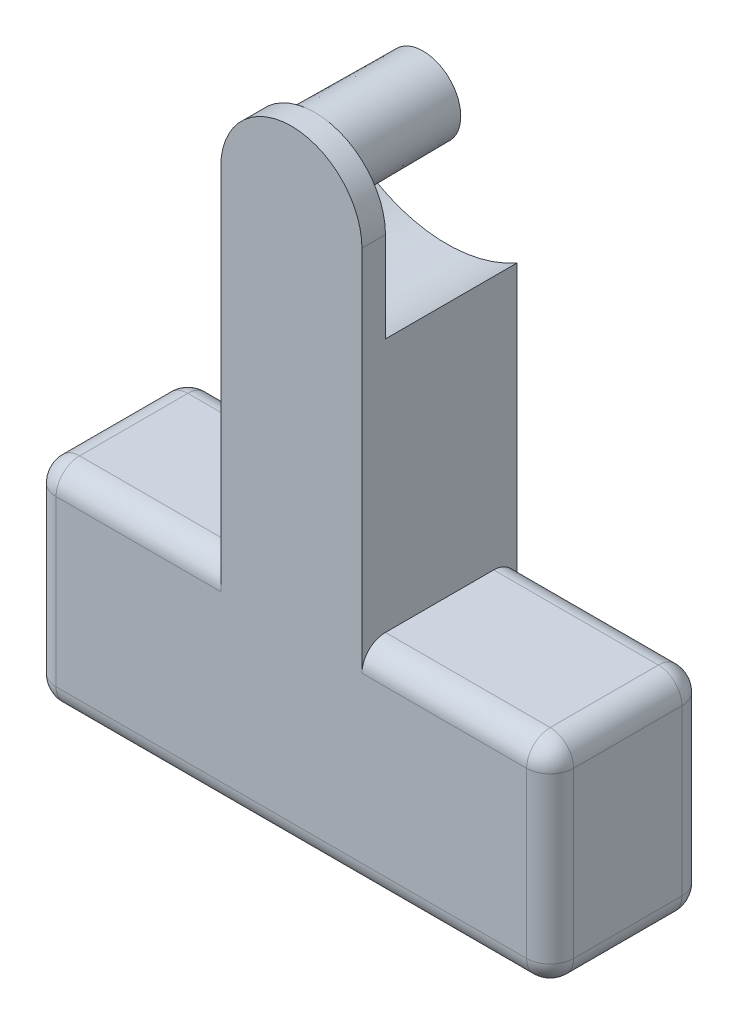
from build123d import *

# Parameters (mm, degrees)
SKETCH1_R           = 8
BOSS_EXTRUDE1_DEPTH = 11.5
DRAFT1_ANGLE        = 0.5
BOSS_EXTRUDE3_DEPTH = 5
BOSS_EXTRUDE4_DEPTH = 28
FILLET2_R           = 5


with BuildPart() as part:
    # Sketch1 → Boss-Extrude1 (new, symmetric)
    with BuildSketch(Plane.XY):
        Circle(SKETCH1_R)
    extrude(amount=BOSS_EXTRUDE1_DEPTH, both=True)

    # Draft1
    draft1_faces = [part.faces().sort_by_distance(p)[0] for p in [
        (-8, 0, 0),
    ]]
    draft(draft1_faces, Plane(origin=(0, 0, -11.5), x_dir=(-1, 0, 0), z_dir=(0, 0, -1)), DRAFT1_ANGLE)

    # Sketch2 → Boss-Extrude3 (add)
    with BuildSketch(Plane.XY.offset(11.5)):
        with BuildLine():
            Line((-15, -6.799282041), (-15, -80))
            Line((-15, -80), (-55, -80))
            Line((-55, -80), (-55, -125))
            Line((-55, -125), (55, -125))
            Line((55, -125), (55, -80))
            Line((55, -80), (15, -80))
            Line((15, -80), (15, -6.799282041))
            ThreePointArc((15, -6.799282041), (0, 8.200717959), (-15, -6.799282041))
        make_face()
    extrude(amount=BOSS_EXTRUDE3_DEPTH)

    # Sketch4 → Boss-Extrude4 (add)
    with BuildSketch(Plane(origin=(0, 0, 11.5), x_dir=(-1, 0, 0), z_dir=(0, 0, -1))):
        with BuildLine():
            Line((-15, -25.980762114), (-15, -80))
            Line((-15, -80), (15, -80))
            Line((15, -80), (15, -25.980762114))
            ThreePointArc((15, -25.980762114), (0, -30), (-15, -25.980762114))
        make_face()
        Polygon((-55, -80), (-55, -125), (55, -125), (55, -80), (15, -80), (-15, -80), align=None)
    extrude(amount=BOSS_EXTRUDE4_DEPTH)

    # Fillet2
    fillet2_edges = [part.edges().sort_by_distance(p)[0] for p in [
        (-35, -80, 16.5),
        (-55, -102.5, 16.5),
        (0, -125, 16.5),
        (55, -102.5, 16.5),
        (35, -80, 16.5),
        (-55, -102.5, -16.5),
        (0, -125, -16.5),
        (55, -102.5, -16.5),
        (35, -80, -16.5),
        (-35, -80, -16.5),
        (-55, -80, 0),
        (-55, -125, 0),
        (55, -125, 0),
        (55, -80, 0),
    ]]
    fillet(fillet2_edges, radius=FILLET2_R)


solid = part.part
